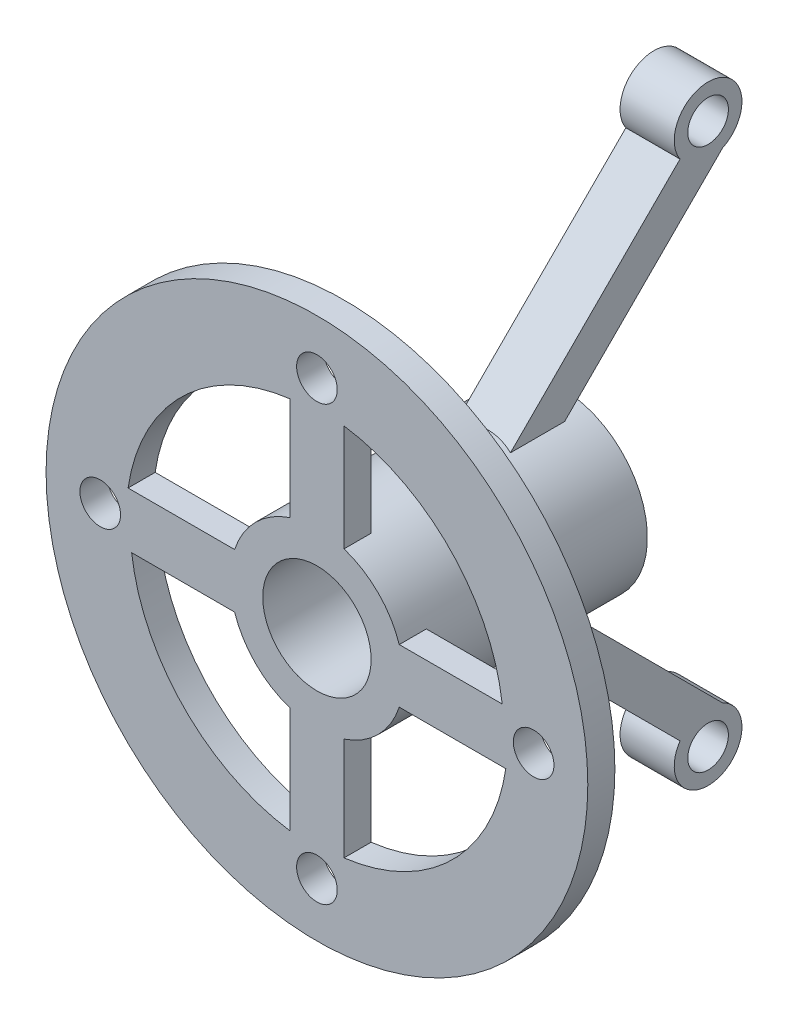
ISO-10303-21;
HEADER;
FILE_DESCRIPTION(('STEP AP214'),'2;1');
FILE_NAME('part.step','',(''),(''),'','','');
FILE_SCHEMA(('AUTOMOTIVE_DESIGN { 1 0 10303 214 1 1 1 1 }'));
ENDSEC;
DATA;
#1=APPLICATION_CONTEXT('core data for automotive mechanical design processes');
#2=APPLICATION_PROTOCOL_DEFINITION('international standard','automotive_design',2000,#1);
#3=PRODUCT_CONTEXT('',#1,'mechanical');
#4=PRODUCT('Part','Part','',(#3));
#5=PRODUCT_RELATED_PRODUCT_CATEGORY('part','',(#4));
#6=PRODUCT_DEFINITION_FORMATION('','',#4);
#7=PRODUCT_DEFINITION_CONTEXT('part definition',#1,'design');
#8=PRODUCT_DEFINITION('design','',#6,#7);
#9=PRODUCT_DEFINITION_SHAPE('','',#8);
#10=(LENGTH_UNIT() NAMED_UNIT(*) SI_UNIT(.MILLI.,.METRE.));
#11=(NAMED_UNIT(*) PLANE_ANGLE_UNIT() SI_UNIT($,.RADIAN.));
#12=(NAMED_UNIT(*) SI_UNIT($,.STERADIAN.) SOLID_ANGLE_UNIT());
#13=UNCERTAINTY_MEASURE_WITH_UNIT(LENGTH_MEASURE(1.E-05),#10,'distance_accuracy_value','');
#14=(GEOMETRIC_REPRESENTATION_CONTEXT(3) GLOBAL_UNCERTAINTY_ASSIGNED_CONTEXT((#13)) GLOBAL_UNIT_ASSIGNED_CONTEXT((#10,
#11,#12)) REPRESENTATION_CONTEXT('',''));
#15=CARTESIAN_POINT('',(0.,0.,0.));
#16=DIRECTION('',(0.,0.,1.));
#17=DIRECTION('',(1.,0.,0.));
#18=AXIS2_PLACEMENT_3D('',#15,#16,#17);
#19=CARTESIAN_POINT('',(6.35,-15.2106724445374,-44.45));
#20=DIRECTION('',(0.,-0.707106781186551,0.707106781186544));
#21=DIRECTION('',(0.,-0.707106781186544,-0.707106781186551));
#22=AXIS2_PLACEMENT_3D('',#19,#20,#21);
#23=PLANE('',#22);
#24=DIRECTION('',(-1.,0.,0.));
#25=VECTOR('',#24,1.);
#26=CARTESIAN_POINT('',(6.35,-56.3219052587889,-85.5612328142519));
#27=LINE('',#26,#25);
#28=CARTESIAN_POINT('',(-6.35,-56.3219052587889,-85.5612328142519));
#29=VERTEX_POINT('',#28);
#30=CARTESIAN_POINT('',(6.35,-56.3219052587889,-85.5612328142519));
#31=VERTEX_POINT('',#30);
#32=EDGE_CURVE('E51',#29,#31,#27,.F.);
#33=ORIENTED_EDGE('',*,*,#32,.F.);
#34=DIRECTION('',(0.,0.707106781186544,0.707106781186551));
#35=VECTOR('',#34,1.);
#36=CARTESIAN_POINT('',(-6.35,-15.2106724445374,-44.45));
#37=LINE('',#36,#35);
#38=CARTESIAN_POINT('',(-6.35,-19.3023288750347,-48.5416564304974));
#39=VERTEX_POINT('',#38);
#40=EDGE_CURVE('E187',#29,#39,#37,.T.);
#41=ORIENTED_EDGE('',*,*,#40,.T.);
#42=CARTESIAN_POINT('',(0.,0.,-29.2393275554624));
#43=DIRECTION('',(0.,-0.707106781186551,0.707106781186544));
#44=DIRECTION('',(0.,-0.707106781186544,-0.707106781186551));
#45=AXIS2_PLACEMENT_3D('',#42,#43,#44);
#46=ELLIPSE('',#45,28.7368195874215,20.32);
#47=CARTESIAN_POINT('',(6.35,-19.3023288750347,-48.5416564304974));
#48=VERTEX_POINT('',#47);
#49=EDGE_CURVE('E40',#39,#48,#46,.T.);
#50=ORIENTED_EDGE('',*,*,#49,.T.);
#51=DIRECTION('',(0.,0.707106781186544,0.707106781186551));
#52=VECTOR('',#51,1.);
#53=CARTESIAN_POINT('',(6.35,-15.2106724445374,-44.45));
#54=LINE('',#53,#52);
#55=EDGE_CURVE('E47',#31,#48,#54,.T.);
#56=ORIENTED_EDGE('',*,*,#55,.F.);
#57=EDGE_LOOP('',(#33,#41,#50,#56));
#58=FACE_BOUND('',#57,.T.);
#59=ADVANCED_FACE('F32',(#58),#23,.F.);
#60=CARTESIAN_POINT('',(6.35,-60.1119530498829,-76.651280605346));
#61=DIRECTION('',(0.,0.707106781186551,-0.707106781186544));
#62=DIRECTION('',(0.,0.707106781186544,0.707106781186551));
#63=AXIS2_PLACEMENT_3D('',#60,#61,#62);
#64=PLANE('',#63);
#65=DIRECTION('',(-1.,0.,0.));
#66=VECTOR('',#65,1.);
#67=CARTESIAN_POINT('',(6.35,-59.0566101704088,-75.5959377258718));
#68=LINE('',#67,#66);
#69=CARTESIAN_POINT('',(6.35,-59.0566101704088,-75.5959377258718));
#70=VERTEX_POINT('',#69);
#71=CARTESIAN_POINT('',(-6.35,-59.0566101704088,-75.5959377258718));
#72=VERTEX_POINT('',#71);
#73=EDGE_CURVE('E412',#70,#72,#68,.T.);
#74=ORIENTED_EDGE('',*,*,#73,.F.);
#75=DIRECTION('',(0.,-0.707106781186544,-0.707106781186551));
#76=VECTOR('',#75,1.);
#77=CARTESIAN_POINT('',(6.35,-60.1119530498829,-76.651280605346));
#78=LINE('',#77,#76);
#79=CARTESIAN_POINT('',(6.35,-19.3023288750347,-35.8416564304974));
#80=VERTEX_POINT('',#79);
#81=EDGE_CURVE('E392',#80,#70,#78,.T.);
#82=ORIENTED_EDGE('',*,*,#81,.F.);
#83=CARTESIAN_POINT('',(0.,0.,-16.5393275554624));
#84=DIRECTION('',(0.,0.707106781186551,-0.707106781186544));
#85=DIRECTION('',(0.,-0.707106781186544,-0.707106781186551));
#86=AXIS2_PLACEMENT_3D('',#83,#84,#85);
#87=ELLIPSE('',#86,28.7368195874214,20.32);
#88=CARTESIAN_POINT('',(-6.35,-19.3023288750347,-35.8416564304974));
#89=VERTEX_POINT('',#88);
#90=EDGE_CURVE('E203',#80,#89,#87,.T.);
#91=ORIENTED_EDGE('',*,*,#90,.T.);
#92=DIRECTION('',(0.,-0.707106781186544,-0.707106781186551));
#93=VECTOR('',#92,1.);
#94=CARTESIAN_POINT('',(-6.35,-60.1119530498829,-76.651280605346));
#95=LINE('',#94,#93);
#96=EDGE_CURVE('E193',#89,#72,#95,.T.);
#97=ORIENTED_EDGE('',*,*,#96,.T.);
#98=EDGE_LOOP('',(#74,#82,#91,#97));
#99=FACE_BOUND('',#98,.T.);
#100=ADVANCED_FACE('F443',(#99),#64,.F.);
#101=CARTESIAN_POINT('',(6.35,60.1119530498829,-76.651280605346));
#102=DIRECTION('',(0.,-0.707106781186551,-0.707106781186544));
#103=DIRECTION('',(0.,0.707106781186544,-0.707106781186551));
#104=AXIS2_PLACEMENT_3D('',#101,#102,#103);
#105=PLANE('',#104);
#106=DIRECTION('',(-1.,0.,0.));
#107=VECTOR('',#106,1.);
#108=CARTESIAN_POINT('',(6.35,59.0566101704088,-75.5959377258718));
#109=LINE('',#108,#107);
#110=CARTESIAN_POINT('',(-6.35,59.0566101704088,-75.5959377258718));
#111=VERTEX_POINT('',#110);
#112=CARTESIAN_POINT('',(6.35,59.0566101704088,-75.5959377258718));
#113=VERTEX_POINT('',#112);
#114=EDGE_CURVE('E194',#111,#113,#109,.F.);
#115=ORIENTED_EDGE('',*,*,#114,.F.);
#116=DIRECTION('',(0.,-0.707106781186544,0.707106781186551));
#117=VECTOR('',#116,1.);
#118=CARTESIAN_POINT('',(-6.35,60.1119530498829,-76.651280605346));
#119=LINE('',#118,#117);
#120=CARTESIAN_POINT('',(-6.35,19.3023288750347,-35.8416564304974));
#121=VERTEX_POINT('',#120);
#122=EDGE_CURVE('E390',#111,#121,#119,.T.);
#123=ORIENTED_EDGE('',*,*,#122,.T.);
#124=CARTESIAN_POINT('',(0.,0.,-16.5393275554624));
#125=DIRECTION('',(0.,-0.707106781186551,-0.707106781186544));
#126=DIRECTION('',(0.,0.707106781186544,-0.707106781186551));
#127=AXIS2_PLACEMENT_3D('',#124,#125,#126);
#128=ELLIPSE('',#127,28.7368195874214,20.32);
#129=CARTESIAN_POINT('',(6.35,19.3023288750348,-35.8416564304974));
#130=VERTEX_POINT('',#129);
#131=EDGE_CURVE('E211',#121,#130,#128,.T.);
#132=ORIENTED_EDGE('',*,*,#131,.T.);
#133=DIRECTION('',(0.,-0.707106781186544,0.707106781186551));
#134=VECTOR('',#133,1.);
#135=CARTESIAN_POINT('',(6.35,60.1119530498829,-76.651280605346));
#136=LINE('',#135,#134);
#137=EDGE_CURVE('E389',#113,#130,#136,.T.);
#138=ORIENTED_EDGE('',*,*,#137,.F.);
#139=EDGE_LOOP('',(#115,#123,#132,#138));
#140=FACE_BOUND('',#139,.T.);
#141=ADVANCED_FACE('F463',(#140),#105,.F.);
#142=CARTESIAN_POINT('',(6.35,15.2106724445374,-44.45));
#143=DIRECTION('',(0.,0.707106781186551,0.707106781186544));
#144=DIRECTION('',(0.,-0.707106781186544,0.707106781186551));
#145=AXIS2_PLACEMENT_3D('',#142,#143,#144);
#146=PLANE('',#145);
#147=DIRECTION('',(-1.,0.,0.));
#148=VECTOR('',#147,1.);
#149=CARTESIAN_POINT('',(6.35,56.3219052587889,-85.5612328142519));
#150=LINE('',#149,#148);
#151=CARTESIAN_POINT('',(6.35,56.3219052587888,-85.5612328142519));
#152=VERTEX_POINT('',#151);
#153=CARTESIAN_POINT('',(-6.35,56.3219052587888,-85.5612328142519));
#154=VERTEX_POINT('',#153);
#155=EDGE_CURVE('E402',#152,#154,#150,.T.);
#156=ORIENTED_EDGE('',*,*,#155,.F.);
#157=DIRECTION('',(0.,0.707106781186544,-0.707106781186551));
#158=VECTOR('',#157,1.);
#159=CARTESIAN_POINT('',(6.35,15.2106724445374,-44.45));
#160=LINE('',#159,#158);
#161=CARTESIAN_POINT('',(6.35,19.3023288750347,-48.5416564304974));
#162=VERTEX_POINT('',#161);
#163=EDGE_CURVE('E385',#162,#152,#160,.T.);
#164=ORIENTED_EDGE('',*,*,#163,.F.);
#165=CARTESIAN_POINT('',(0.,0.,-29.2393275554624));
#166=DIRECTION('',(0.,0.707106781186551,0.707106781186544));
#167=DIRECTION('',(0.,0.707106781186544,-0.707106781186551));
#168=AXIS2_PLACEMENT_3D('',#165,#166,#167);
#169=ELLIPSE('',#168,28.7368195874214,20.32);
#170=CARTESIAN_POINT('',(-6.35,19.3023288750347,-48.5416564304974));
#171=VERTEX_POINT('',#170);
#172=EDGE_CURVE('E214',#162,#171,#169,.T.);
#173=ORIENTED_EDGE('',*,*,#172,.T.);
#174=DIRECTION('',(0.,0.707106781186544,-0.707106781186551));
#175=VECTOR('',#174,1.);
#176=CARTESIAN_POINT('',(-6.35,15.2106724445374,-44.45));
#177=LINE('',#176,#175);
#178=EDGE_CURVE('E386',#171,#154,#177,.T.);
#179=ORIENTED_EDGE('',*,*,#178,.T.);
#180=EDGE_LOOP('',(#156,#164,#173,#179));
#181=FACE_BOUND('',#180,.T.);
#182=ADVANCED_FACE('F475',(#181),#146,.F.);
#183=CARTESIAN_POINT('',(0.,0.,3.176));
#184=DIRECTION('',(0.,0.,-1.));
#185=DIRECTION('',(-1.,0.,0.));
#186=AXIS2_PLACEMENT_3D('',#183,#184,#185);
#187=CYLINDRICAL_SURFACE('',#186,20.32);
#188=CARTESIAN_POINT('',(0.,0.,-53.975));
#189=DIRECTION('',(0.,0.,-1.));
#190=DIRECTION('',(-1.,0.,0.));
#191=AXIS2_PLACEMENT_3D('',#188,#189,#190);
#192=CIRCLE('',#191,20.32);
#193=CARTESIAN_POINT('',(-20.32,0.,-53.975));
#194=VERTEX_POINT('',#193);
#195=EDGE_CURVE('E287',#194,#194,#192,.T.);
#196=ORIENTED_EDGE('',*,*,#195,.F.);
#197=EDGE_LOOP('',(#196));
#198=FACE_BOUND('',#197,.T.);
#199=DIRECTION('',(0.,0.,-1.));
#200=VECTOR('',#199,1.);
#201=CARTESIAN_POINT('',(19.3023288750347,6.35,3.176));
#202=LINE('',#201,#200);
#203=CARTESIAN_POINT('',(19.3023288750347,6.35,3.175));
#204=VERTEX_POINT('',#203);
#205=CARTESIAN_POINT('',(19.3023288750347,6.35,-3.175));
#206=VERTEX_POINT('',#205);
#207=EDGE_CURVE('E351',#204,#206,#202,.T.);
#208=ORIENTED_EDGE('',*,*,#207,.T.);
#209=CARTESIAN_POINT('',(0.,0.,-3.175));
#210=DIRECTION('',(0.,0.,-1.));
#211=DIRECTION('',(-1.,0.,0.));
#212=AXIS2_PLACEMENT_3D('',#209,#210,#211);
#213=CIRCLE('',#212,20.32);
#214=CARTESIAN_POINT('',(19.3023288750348,-6.3499999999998,-3.175));
#215=VERTEX_POINT('',#214);
#216=EDGE_CURVE('E379',#206,#215,#213,.T.);
#217=ORIENTED_EDGE('',*,*,#216,.T.);
#218=DIRECTION('',(0.,0.,-1.));
#219=VECTOR('',#218,1.);
#220=CARTESIAN_POINT('',(19.3023288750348,-6.3499999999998,3.176));
#221=LINE('',#220,#219);
#222=CARTESIAN_POINT('',(19.3023288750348,-6.3499999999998,3.175));
#223=VERTEX_POINT('',#222);
#224=EDGE_CURVE('E261',#223,#215,#221,.T.);
#225=ORIENTED_EDGE('',*,*,#224,.F.);
#226=CARTESIAN_POINT('',(0.,0.,3.175));
#227=DIRECTION('',(0.,0.,1.));
#228=DIRECTION('',(1.,0.,0.));
#229=AXIS2_PLACEMENT_3D('',#226,#227,#228);
#230=CIRCLE('',#229,20.32);
#231=CARTESIAN_POINT('',(6.3500000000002,-19.3023288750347,3.175));
#232=VERTEX_POINT('',#231);
#233=EDGE_CURVE('E278',#232,#223,#230,.T.);
#234=ORIENTED_EDGE('',*,*,#233,.F.);
#235=DIRECTION('',(0.,0.,-1.));
#236=VECTOR('',#235,1.);
#237=CARTESIAN_POINT('',(6.3500000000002,-19.3023288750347,3.176));
#238=LINE('',#237,#236);
#239=CARTESIAN_POINT('',(6.3500000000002,-19.3023288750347,-3.175));
#240=VERTEX_POINT('',#239);
#241=EDGE_CURVE('E260',#232,#240,#238,.T.);
#242=ORIENTED_EDGE('',*,*,#241,.T.);
#243=CARTESIAN_POINT('',(-6.34999999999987,-19.3023288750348,-3.175));
#244=VERTEX_POINT('',#243);
#245=EDGE_CURVE('E828',#240,#244,#213,.T.);
#246=ORIENTED_EDGE('',*,*,#245,.T.);
#247=DIRECTION('',(0.,0.,-1.));
#248=VECTOR('',#247,1.);
#249=CARTESIAN_POINT('',(-6.34999999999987,-19.3023288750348,3.176));
#250=LINE('',#249,#248);
#251=CARTESIAN_POINT('',(-6.34999999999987,-19.3023288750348,3.175));
#252=VERTEX_POINT('',#251);
#253=EDGE_CURVE('E293',#252,#244,#250,.T.);
#254=ORIENTED_EDGE('',*,*,#253,.F.);
#255=CARTESIAN_POINT('',(0.,0.,3.175));
#256=DIRECTION('',(0.,0.,1.));
#257=DIRECTION('',(1.,0.,0.));
#258=AXIS2_PLACEMENT_3D('',#255,#256,#257);
#259=CIRCLE('',#258,20.32);
#260=CARTESIAN_POINT('',(-19.3023288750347,-6.35000000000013,3.175));
#261=VERTEX_POINT('',#260);
#262=EDGE_CURVE('E310',#261,#252,#259,.T.);
#263=ORIENTED_EDGE('',*,*,#262,.F.);
#264=DIRECTION('',(0.,0.,-1.));
#265=VECTOR('',#264,1.);
#266=CARTESIAN_POINT('',(-19.3023288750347,-6.35000000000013,3.176));
#267=LINE('',#266,#265);
#268=CARTESIAN_POINT('',(-19.3023288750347,-6.35000000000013,-3.175));
#269=VERTEX_POINT('',#268);
#270=EDGE_CURVE('E292',#261,#269,#267,.T.);
#271=ORIENTED_EDGE('',*,*,#270,.T.);
#272=CARTESIAN_POINT('',(-19.3023288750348,6.34999999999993,-3.175));
#273=VERTEX_POINT('',#272);
#274=EDGE_CURVE('E228',#269,#273,#213,.T.);
#275=ORIENTED_EDGE('',*,*,#274,.T.);
#276=DIRECTION('',(0.,0.,-1.));
#277=VECTOR('',#276,1.);
#278=CARTESIAN_POINT('',(-19.3023288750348,6.34999999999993,3.176));
#279=LINE('',#278,#277);
#280=CARTESIAN_POINT('',(-19.3023288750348,6.34999999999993,3.175));
#281=VERTEX_POINT('',#280);
#282=EDGE_CURVE('E323',#281,#273,#279,.T.);
#283=ORIENTED_EDGE('',*,*,#282,.F.);
#284=CARTESIAN_POINT('',(0.,0.,3.175));
#285=DIRECTION('',(0.,0.,1.));
#286=DIRECTION('',(1.,0.,0.));
#287=AXIS2_PLACEMENT_3D('',#284,#285,#286);
#288=CIRCLE('',#287,20.32);
#289=CARTESIAN_POINT('',(-6.35000000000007,19.3023288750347,3.175));
#290=VERTEX_POINT('',#289);
#291=EDGE_CURVE('E341',#290,#281,#288,.T.);
#292=ORIENTED_EDGE('',*,*,#291,.F.);
#293=DIRECTION('',(0.,0.,-1.));
#294=VECTOR('',#293,1.);
#295=CARTESIAN_POINT('',(-6.35000000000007,19.3023288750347,3.176));
#296=LINE('',#295,#294);
#297=CARTESIAN_POINT('',(-6.35000000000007,19.3023288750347,-3.175));
#298=VERTEX_POINT('',#297);
#299=EDGE_CURVE('E322',#290,#298,#296,.T.);
#300=ORIENTED_EDGE('',*,*,#299,.T.);
#301=CARTESIAN_POINT('',(6.35,19.3023288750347,-3.175));
#302=VERTEX_POINT('',#301);
#303=EDGE_CURVE('E220',#298,#302,#213,.T.);
#304=ORIENTED_EDGE('',*,*,#303,.T.);
#305=DIRECTION('',(0.,0.,-1.));
#306=VECTOR('',#305,1.);
#307=CARTESIAN_POINT('',(6.35,19.3023288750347,3.176));
#308=LINE('',#307,#306);
#309=CARTESIAN_POINT('',(6.35,19.3023288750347,3.175));
#310=VERTEX_POINT('',#309);
#311=EDGE_CURVE('E352',#310,#302,#308,.T.);
#312=ORIENTED_EDGE('',*,*,#311,.F.);
#313=CARTESIAN_POINT('',(0.,0.,3.175));
#314=DIRECTION('',(0.,0.,1.));
#315=DIRECTION('',(1.,0.,0.));
#316=AXIS2_PLACEMENT_3D('',#313,#314,#315);
#317=CIRCLE('',#316,20.32);
#318=EDGE_CURVE('E369',#204,#310,#317,.T.);
#319=ORIENTED_EDGE('',*,*,#318,.F.);
#320=EDGE_LOOP('',(#208,#217,#225,#234,#242,#246,#254,#263,#271,#275,#283,#292,#300,#304,#312,#319));
#321=FACE_BOUND('',#320,.T.);
#322=ORIENTED_EDGE('',*,*,#172,.F.);
#323=DIRECTION('',(0.,0.,-1.));
#324=VECTOR('',#323,1.);
#325=CARTESIAN_POINT('',(6.35,19.3023288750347,3.176));
#326=LINE('',#325,#324);
#327=EDGE_CURVE('E204',#162,#130,#326,.F.);
#328=ORIENTED_EDGE('',*,*,#327,.T.);
#329=ORIENTED_EDGE('',*,*,#131,.F.);
#330=DIRECTION('',(0.,0.,-1.));
#331=VECTOR('',#330,1.);
#332=CARTESIAN_POINT('',(-6.35,19.3023288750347,3.176));
#333=LINE('',#332,#331);
#334=EDGE_CURVE('E217',#171,#121,#333,.F.);
#335=ORIENTED_EDGE('',*,*,#334,.F.);
#336=EDGE_LOOP('',(#322,#328,#329,#335));
#337=FACE_BOUND('',#336,.T.);
#338=DIRECTION('',(0.,0.,-1.));
#339=VECTOR('',#338,1.);
#340=CARTESIAN_POINT('',(6.35,-19.3023288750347,3.176));
#341=LINE('',#340,#339);
#342=EDGE_CURVE('E11',#48,#80,#341,.F.);
#343=ORIENTED_EDGE('',*,*,#342,.F.);
#344=ORIENTED_EDGE('',*,*,#49,.F.);
#345=DIRECTION('',(0.,0.,-1.));
#346=VECTOR('',#345,1.);
#347=CARTESIAN_POINT('',(-6.35,-19.3023288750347,3.176));
#348=LINE('',#347,#346);
#349=EDGE_CURVE('E197',#39,#89,#348,.F.);
#350=ORIENTED_EDGE('',*,*,#349,.T.);
#351=ORIENTED_EDGE('',*,*,#90,.F.);
#352=EDGE_LOOP('',(#343,#344,#350,#351));
#353=FACE_BOUND('',#352,.T.);
#354=ADVANCED_FACE('F206',(#198,#321,#337,#353),#187,.T.);
#355=CARTESIAN_POINT('',(0.,0.,3.175));
#356=DIRECTION('',(0.,0.,-1.));
#357=DIRECTION('',(-1.,0.,0.));
#358=AXIS2_PLACEMENT_3D('',#355,#356,#357);
#359=CYLINDRICAL_SURFACE('',#358,63.5);
#360=CARTESIAN_POINT('',(0.,0.,3.175));
#361=DIRECTION('',(0.,0.,1.));
#362=DIRECTION('',(1.,0.,0.));
#363=AXIS2_PLACEMENT_3D('',#360,#361,#362);
#364=CIRCLE('',#363,63.5);
#365=CARTESIAN_POINT('',(63.5,0.,3.175));
#366=VERTEX_POINT('',#365);
#367=EDGE_CURVE('E224',#366,#366,#364,.T.);
#368=ORIENTED_EDGE('',*,*,#367,.F.);
#369=EDGE_LOOP('',(#368));
#370=FACE_BOUND('',#369,.T.);
#371=CARTESIAN_POINT('',(0.,0.,-3.175));
#372=DIRECTION('',(0.,0.,1.));
#373=DIRECTION('',(1.,0.,0.));
#374=AXIS2_PLACEMENT_3D('',#371,#372,#373);
#375=CIRCLE('',#374,63.5);
#376=CARTESIAN_POINT('',(63.5,0.,-3.175));
#377=VERTEX_POINT('',#376);
#378=EDGE_CURVE('E221',#377,#377,#375,.T.);
#379=ORIENTED_EDGE('',*,*,#378,.T.);
#380=EDGE_LOOP('',(#379));
#381=FACE_BOUND('',#380,.T.);
#382=ADVANCED_FACE('F34',(#370,#381),#359,.T.);
#383=CARTESIAN_POINT('',(0.,0.,3.175));
#384=DIRECTION('',(0.,0.,1.));
#385=DIRECTION('',(1.,0.,0.));
#386=AXIS2_PLACEMENT_3D('',#383,#384,#385);
#387=PLANE('',#386);
#388=ORIENTED_EDGE('',*,*,#318,.T.);
#389=DIRECTION('',(0.,1.,0.));
#390=VECTOR('',#389,1.);
#391=CARTESIAN_POINT('',(6.35,19.3023288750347,3.175));
#392=LINE('',#391,#390);
#393=CARTESIAN_POINT('',(6.35,44.2743722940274,3.175));
#394=VERTEX_POINT('',#393);
#395=EDGE_CURVE('E255',#310,#394,#392,.T.);
#396=ORIENTED_EDGE('',*,*,#395,.T.);
#397=CARTESIAN_POINT('',(0.,0.973685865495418,3.175));
#398=DIRECTION('',(0.,0.,1.));
#399=DIRECTION('',(1.,0.,0.));
#400=AXIS2_PLACEMENT_3D('',#397,#398,#399);
#401=CIRCLE('',#400,43.7638200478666);
#402=CARTESIAN_POINT('',(43.4323288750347,6.35,3.175));
#403=VERTEX_POINT('',#402);
#404=EDGE_CURVE('E321',#394,#403,#401,.F.);
#405=ORIENTED_EDGE('',*,*,#404,.T.);
#406=DIRECTION('',(-1.,0.,0.));
#407=VECTOR('',#406,1.);
#408=CARTESIAN_POINT('',(19.3023288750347,6.35,3.175));
#409=LINE('',#408,#407);
#410=EDGE_CURVE('E372',#403,#204,#409,.T.);
#411=ORIENTED_EDGE('',*,*,#410,.T.);
#412=EDGE_LOOP('',(#388,#396,#405,#411));
#413=FACE_BOUND('',#412,.T.);
#414=ORIENTED_EDGE('',*,*,#291,.T.);
#415=DIRECTION('',(-1.,0.,0.));
#416=VECTOR('',#415,1.);
#417=CARTESIAN_POINT('',(-19.3023288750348,6.34999999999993,3.175));
#418=LINE('',#417,#416);
#419=CARTESIAN_POINT('',(-44.2743722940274,6.34999999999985,3.175));
#420=VERTEX_POINT('',#419);
#421=EDGE_CURVE('E318',#281,#420,#418,.T.);
#422=ORIENTED_EDGE('',*,*,#421,.T.);
#423=CARTESIAN_POINT('',(-0.973685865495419,0.,3.175));
#424=DIRECTION('',(0.,0.,1.));
#425=DIRECTION('',(1.,0.,0.));
#426=AXIS2_PLACEMENT_3D('',#423,#424,#425);
#427=CIRCLE('',#426,43.7638200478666);
#428=CARTESIAN_POINT('',(-6.35000000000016,43.4323288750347,3.175));
#429=VERTEX_POINT('',#428);
#430=EDGE_CURVE('E291',#420,#429,#427,.F.);
#431=ORIENTED_EDGE('',*,*,#430,.T.);
#432=DIRECTION('',(0.,-1.,0.));
#433=VECTOR('',#432,1.);
#434=CARTESIAN_POINT('',(-6.35000000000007,19.3023288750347,3.175));
#435=LINE('',#434,#433);
#436=EDGE_CURVE('E344',#429,#290,#435,.T.);
#437=ORIENTED_EDGE('',*,*,#436,.T.);
#438=EDGE_LOOP('',(#414,#422,#431,#437));
#439=FACE_BOUND('',#438,.T.);
#440=ORIENTED_EDGE('',*,*,#262,.T.);
#441=DIRECTION('',(0.,-1.,0.));
#442=VECTOR('',#441,1.);
#443=CARTESIAN_POINT('',(-6.34999999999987,-19.3023288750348,3.175));
#444=LINE('',#443,#442);
#445=CARTESIAN_POINT('',(-6.34999999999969,-44.2743722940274,3.175));
#446=VERTEX_POINT('',#445);
#447=EDGE_CURVE('E288',#252,#446,#444,.T.);
#448=ORIENTED_EDGE('',*,*,#447,.T.);
#449=CARTESIAN_POINT('',(0.,-0.973685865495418,3.175));
#450=DIRECTION('',(0.,0.,1.));
#451=DIRECTION('',(1.,0.,0.));
#452=AXIS2_PLACEMENT_3D('',#449,#450,#451);
#453=CIRCLE('',#452,43.7638200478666);
#454=CARTESIAN_POINT('',(-43.4323288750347,-6.35000000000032,3.175));
#455=VERTEX_POINT('',#454);
#456=EDGE_CURVE('E259',#446,#455,#453,.F.);
#457=ORIENTED_EDGE('',*,*,#456,.T.);
#458=DIRECTION('',(1.,0.,0.));
#459=VECTOR('',#458,1.);
#460=CARTESIAN_POINT('',(-19.3023288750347,-6.35000000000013,3.175));
#461=LINE('',#460,#459);
#462=EDGE_CURVE('E313',#455,#261,#461,.T.);
#463=ORIENTED_EDGE('',*,*,#462,.T.);
#464=EDGE_LOOP('',(#440,#448,#457,#463));
#465=FACE_BOUND('',#464,.T.);
#466=ORIENTED_EDGE('',*,*,#233,.T.);
#467=DIRECTION('',(1.,0.,0.));
#468=VECTOR('',#467,1.);
#469=CARTESIAN_POINT('',(19.3023288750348,-6.3499999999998,3.175));
#470=LINE('',#469,#468);
#471=CARTESIAN_POINT('',(44.2743722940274,-6.34999999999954,3.175));
#472=VERTEX_POINT('',#471);
#473=EDGE_CURVE('E256',#223,#472,#470,.T.);
#474=ORIENTED_EDGE('',*,*,#473,.T.);
#475=CARTESIAN_POINT('',(0.973685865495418,0.,3.175));
#476=DIRECTION('',(0.,0.,1.));
#477=DIRECTION('',(1.,0.,0.));
#478=AXIS2_PLACEMENT_3D('',#475,#476,#477);
#479=CIRCLE('',#478,43.7638200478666);
#480=CARTESIAN_POINT('',(6.35000000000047,-43.4323288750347,3.175));
#481=VERTEX_POINT('',#480);
#482=EDGE_CURVE('E284',#472,#481,#479,.F.);
#483=ORIENTED_EDGE('',*,*,#482,.T.);
#484=DIRECTION('',(0.,1.,0.));
#485=VECTOR('',#484,1.);
#486=CARTESIAN_POINT('',(6.3500000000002,-19.3023288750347,3.175));
#487=LINE('',#486,#485);
#488=EDGE_CURVE('E281',#481,#232,#487,.T.);
#489=ORIENTED_EDGE('',*,*,#488,.T.);
#490=EDGE_LOOP('',(#466,#474,#483,#489));
#491=FACE_BOUND('',#490,.T.);
#492=CARTESIAN_POINT('',(0.,0.,3.175));
#493=DIRECTION('',(0.,0.,1.));
#494=DIRECTION('',(1.,0.,0.));
#495=AXIS2_PLACEMENT_3D('',#492,#493,#494);
#496=CIRCLE('',#495,12.7);
#497=CARTESIAN_POINT('',(12.7,0.,3.175));
#498=VERTEX_POINT('',#497);
#499=EDGE_CURVE('E248',#498,#498,#496,.F.);
#500=ORIENTED_EDGE('',*,*,#499,.T.);
#501=EDGE_LOOP('',(#500));
#502=FACE_BOUND('',#501,.T.);
#503=CARTESIAN_POINT('',(0.,-50.8,3.175));
#504=DIRECTION('',(0.,0.,1.));
#505=DIRECTION('',(-1.,0.,0.));
#506=AXIS2_PLACEMENT_3D('',#503,#504,#505);
#507=CIRCLE('',#506,4.7625);
#508=CARTESIAN_POINT('',(-4.7625,-50.8,3.175));
#509=VERTEX_POINT('',#508);
#510=EDGE_CURVE('E244',#509,#509,#507,.T.);
#511=ORIENTED_EDGE('',*,*,#510,.F.);
#512=EDGE_LOOP('',(#511));
#513=FACE_BOUND('',#512,.T.);
#514=CARTESIAN_POINT('',(-50.8,5.32101756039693E-13,3.175));
#515=DIRECTION('',(0.,0.,1.));
#516=DIRECTION('',(0.,1.,0.));
#517=AXIS2_PLACEMENT_3D('',#514,#515,#516);
#518=CIRCLE('',#517,4.7625);
#519=CARTESIAN_POINT('',(-50.7999999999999,4.76250000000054,3.175));
#520=VERTEX_POINT('',#519);
#521=EDGE_CURVE('E245',#520,#520,#518,.T.);
#522=ORIENTED_EDGE('',*,*,#521,.F.);
#523=EDGE_LOOP('',(#522));
#524=FACE_BOUND('',#523,.T.);
#525=CARTESIAN_POINT('',(50.8,-1.77367252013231E-13,3.175));
#526=DIRECTION('',(0.,0.,1.));
#527=DIRECTION('',(0.,-1.,0.));
#528=AXIS2_PLACEMENT_3D('',#525,#526,#527);
#529=CIRCLE('',#528,4.7625);
#530=CARTESIAN_POINT('',(50.8,-4.76250000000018,3.175));
#531=VERTEX_POINT('',#530);
#532=EDGE_CURVE('E237',#531,#531,#529,.T.);
#533=ORIENTED_EDGE('',*,*,#532,.F.);
#534=EDGE_LOOP('',(#533));
#535=FACE_BOUND('',#534,.T.);
#536=CARTESIAN_POINT('',(0.,50.8,3.175));
#537=DIRECTION('',(0.,0.,1.));
#538=DIRECTION('',(1.,0.,0.));
#539=AXIS2_PLACEMENT_3D('',#536,#537,#538);
#540=CIRCLE('',#539,4.7625);
#541=CARTESIAN_POINT('',(4.7625,50.8,3.175));
#542=VERTEX_POINT('',#541);
#543=EDGE_CURVE('E231',#542,#542,#540,.T.);
#544=ORIENTED_EDGE('',*,*,#543,.F.);
#545=EDGE_LOOP('',(#544));
#546=FACE_BOUND('',#545,.T.);
#547=ORIENTED_EDGE('',*,*,#367,.T.);
#548=EDGE_LOOP('',(#547));
#549=FACE_BOUND('',#548,.T.);
#550=ADVANCED_FACE('F557',(#413,#439,#465,#491,#502,#513,#524,#535,#546,#549),#387,.T.);
#551=CARTESIAN_POINT('',(0.,0.,-3.175));
#552=DIRECTION('',(0.,0.,1.));
#553=DIRECTION('',(1.,0.,0.));
#554=AXIS2_PLACEMENT_3D('',#551,#552,#553);
#555=PLANE('',#554);
#556=ORIENTED_EDGE('',*,*,#303,.F.);
#557=DIRECTION('',(0.,-1.,0.));
#558=VECTOR('',#557,1.);
#559=CARTESIAN_POINT('',(-6.35000000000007,19.3023288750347,-3.175));
#560=LINE('',#559,#558);
#561=CARTESIAN_POINT('',(-6.35000000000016,43.4323288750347,-3.175));
#562=VERTEX_POINT('',#561);
#563=EDGE_CURVE('E327',#562,#298,#560,.T.);
#564=ORIENTED_EDGE('',*,*,#563,.F.);
#565=CARTESIAN_POINT('',(-0.973685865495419,0.,-3.175));
#566=DIRECTION('',(0.,0.,-1.));
#567=DIRECTION('',(-1.,0.,0.));
#568=AXIS2_PLACEMENT_3D('',#565,#566,#567);
#569=CIRCLE('',#568,43.7638200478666);
#570=CARTESIAN_POINT('',(-44.2743722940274,6.34999999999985,-3.175));
#571=VERTEX_POINT('',#570);
#572=EDGE_CURVE('E335',#571,#562,#569,.T.);
#573=ORIENTED_EDGE('',*,*,#572,.F.);
#574=DIRECTION('',(-1.,0.,0.));
#575=VECTOR('',#574,1.);
#576=CARTESIAN_POINT('',(-19.3023288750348,6.34999999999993,-3.175));
#577=LINE('',#576,#575);
#578=EDGE_CURVE('E338',#273,#571,#577,.T.);
#579=ORIENTED_EDGE('',*,*,#578,.F.);
#580=ORIENTED_EDGE('',*,*,#274,.F.);
#581=DIRECTION('',(1.,0.,0.));
#582=VECTOR('',#581,1.);
#583=CARTESIAN_POINT('',(-19.3023288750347,-6.35000000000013,-3.175));
#584=LINE('',#583,#582);
#585=CARTESIAN_POINT('',(-43.4323288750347,-6.35000000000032,-3.175));
#586=VERTEX_POINT('',#585);
#587=EDGE_CURVE('E296',#586,#269,#584,.T.);
#588=ORIENTED_EDGE('',*,*,#587,.F.);
#589=CARTESIAN_POINT('',(0.,-0.973685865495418,-3.175));
#590=DIRECTION('',(0.,0.,-1.));
#591=DIRECTION('',(-1.,0.,0.));
#592=AXIS2_PLACEMENT_3D('',#589,#590,#591);
#593=CIRCLE('',#592,43.7638200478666);
#594=CARTESIAN_POINT('',(-6.34999999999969,-44.2743722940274,-3.175));
#595=VERTEX_POINT('',#594);
#596=EDGE_CURVE('E304',#595,#586,#593,.T.);
#597=ORIENTED_EDGE('',*,*,#596,.F.);
#598=DIRECTION('',(0.,-1.,0.));
#599=VECTOR('',#598,1.);
#600=CARTESIAN_POINT('',(-6.34999999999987,-19.3023288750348,-3.175));
#601=LINE('',#600,#599);
#602=EDGE_CURVE('E307',#244,#595,#601,.T.);
#603=ORIENTED_EDGE('',*,*,#602,.F.);
#604=ORIENTED_EDGE('',*,*,#245,.F.);
#605=DIRECTION('',(0.,1.,0.));
#606=VECTOR('',#605,1.);
#607=CARTESIAN_POINT('',(6.3500000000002,-19.3023288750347,-3.175));
#608=LINE('',#607,#606);
#609=CARTESIAN_POINT('',(6.35000000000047,-43.4323288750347,-3.175));
#610=VERTEX_POINT('',#609);
#611=EDGE_CURVE('E264',#610,#240,#608,.T.);
#612=ORIENTED_EDGE('',*,*,#611,.F.);
#613=CARTESIAN_POINT('',(0.973685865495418,0.,-3.175));
#614=DIRECTION('',(0.,0.,-1.));
#615=DIRECTION('',(-1.,0.,0.));
#616=AXIS2_PLACEMENT_3D('',#613,#614,#615);
#617=CIRCLE('',#616,43.7638200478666);
#618=CARTESIAN_POINT('',(44.2743722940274,-6.34999999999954,-3.175));
#619=VERTEX_POINT('',#618);
#620=EDGE_CURVE('E272',#619,#610,#617,.T.);
#621=ORIENTED_EDGE('',*,*,#620,.F.);
#622=DIRECTION('',(1.,0.,0.));
#623=VECTOR('',#622,1.);
#624=CARTESIAN_POINT('',(19.3023288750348,-6.3499999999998,-3.175));
#625=LINE('',#624,#623);
#626=EDGE_CURVE('E275',#215,#619,#625,.T.);
#627=ORIENTED_EDGE('',*,*,#626,.F.);
#628=ORIENTED_EDGE('',*,*,#216,.F.);
#629=DIRECTION('',(-1.,0.,0.));
#630=VECTOR('',#629,1.);
#631=CARTESIAN_POINT('',(19.3023288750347,6.35,-3.175));
#632=LINE('',#631,#630);
#633=CARTESIAN_POINT('',(43.4323288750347,6.35,-3.175));
#634=VERTEX_POINT('',#633);
#635=EDGE_CURVE('E355',#634,#206,#632,.T.);
#636=ORIENTED_EDGE('',*,*,#635,.F.);
#637=CARTESIAN_POINT('',(0.,0.973685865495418,-3.175));
#638=DIRECTION('',(0.,0.,-1.));
#639=DIRECTION('',(-1.,0.,0.));
#640=AXIS2_PLACEMENT_3D('',#637,#638,#639);
#641=CIRCLE('',#640,43.7638200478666);
#642=CARTESIAN_POINT('',(6.35,44.2743722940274,-3.175));
#643=VERTEX_POINT('',#642);
#644=EDGE_CURVE('E363',#643,#634,#641,.T.);
#645=ORIENTED_EDGE('',*,*,#644,.F.);
#646=DIRECTION('',(0.,1.,0.));
#647=VECTOR('',#646,1.);
#648=CARTESIAN_POINT('',(6.35,19.3023288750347,-3.175));
#649=LINE('',#648,#647);
#650=EDGE_CURVE('E366',#302,#643,#649,.T.);
#651=ORIENTED_EDGE('',*,*,#650,.F.);
#652=EDGE_LOOP('',(#556,#564,#573,#579,#580,#588,#597,#603,#604,#612,#621,#627,#628,#636,#645,#651));
#653=FACE_BOUND('',#652,.T.);
#654=CARTESIAN_POINT('',(0.,-50.8,-3.175));
#655=DIRECTION('',(0.,0.,1.));
#656=DIRECTION('',(1.,0.,0.));
#657=AXIS2_PLACEMENT_3D('',#654,#655,#656);
#658=CIRCLE('',#657,4.7625);
#659=CARTESIAN_POINT('',(4.7625,-50.8,-3.175));
#660=VERTEX_POINT('',#659);
#661=EDGE_CURVE('E240',#660,#660,#658,.F.);
#662=ORIENTED_EDGE('',*,*,#661,.F.);
#663=EDGE_LOOP('',(#662));
#664=FACE_BOUND('',#663,.T.);
#665=CARTESIAN_POINT('',(-50.8,5.32101756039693E-13,-3.175));
#666=DIRECTION('',(0.,0.,1.));
#667=DIRECTION('',(1.,0.,0.));
#668=AXIS2_PLACEMENT_3D('',#665,#666,#667);
#669=CIRCLE('',#668,4.7625);
#670=CARTESIAN_POINT('',(-46.0375,5.32101756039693E-13,-3.175));
#671=VERTEX_POINT('',#670);
#672=EDGE_CURVE('E241',#671,#671,#669,.F.);
#673=ORIENTED_EDGE('',*,*,#672,.F.);
#674=EDGE_LOOP('',(#673));
#675=FACE_BOUND('',#674,.T.);
#676=CARTESIAN_POINT('',(50.8,-1.77367252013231E-13,-3.175));
#677=DIRECTION('',(0.,0.,1.));
#678=DIRECTION('',(1.,0.,0.));
#679=AXIS2_PLACEMENT_3D('',#676,#677,#678);
#680=CIRCLE('',#679,4.7625);
#681=CARTESIAN_POINT('',(55.5625,-1.77367252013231E-13,-3.175));
#682=VERTEX_POINT('',#681);
#683=EDGE_CURVE('E234',#682,#682,#680,.F.);
#684=ORIENTED_EDGE('',*,*,#683,.F.);
#685=EDGE_LOOP('',(#684));
#686=FACE_BOUND('',#685,.T.);
#687=CARTESIAN_POINT('',(0.,50.8,-3.175));
#688=DIRECTION('',(0.,0.,1.));
#689=DIRECTION('',(1.,0.,0.));
#690=AXIS2_PLACEMENT_3D('',#687,#688,#689);
#691=CIRCLE('',#690,4.7625);
#692=CARTESIAN_POINT('',(4.7625,50.8,-3.175));
#693=VERTEX_POINT('',#692);
#694=EDGE_CURVE('E225',#693,#693,#691,.F.);
#695=ORIENTED_EDGE('',*,*,#694,.F.);
#696=EDGE_LOOP('',(#695));
#697=FACE_BOUND('',#696,.T.);
#698=ORIENTED_EDGE('',*,*,#378,.F.);
#699=EDGE_LOOP('',(#698));
#700=FACE_BOUND('',#699,.T.);
#701=ADVANCED_FACE('F555',(#653,#664,#675,#686,#697,#700),#555,.F.);
#702=CARTESIAN_POINT('',(0.,50.8,-3.176));
#703=DIRECTION('',(0.,0.,1.));
#704=DIRECTION('',(1.,0.,0.));
#705=AXIS2_PLACEMENT_3D('',#702,#703,#704);
#706=CYLINDRICAL_SURFACE('',#705,4.7625);
#707=ORIENTED_EDGE('',*,*,#543,.T.);
#708=EDGE_LOOP('',(#707));
#709=FACE_BOUND('',#708,.T.);
#710=ORIENTED_EDGE('',*,*,#694,.T.);
#711=EDGE_LOOP('',(#710));
#712=FACE_BOUND('',#711,.T.);
#713=ADVANCED_FACE('F551',(#709,#712),#706,.F.);
#714=CARTESIAN_POINT('',(50.8,-1.77367252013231E-13,-3.176));
#715=DIRECTION('',(0.,0.,1.));
#716=DIRECTION('',(1.,0.,0.));
#717=AXIS2_PLACEMENT_3D('',#714,#715,#716);
#718=CYLINDRICAL_SURFACE('',#717,4.7625);
#719=ORIENTED_EDGE('',*,*,#532,.T.);
#720=EDGE_LOOP('',(#719));
#721=FACE_BOUND('',#720,.T.);
#722=ORIENTED_EDGE('',*,*,#683,.T.);
#723=EDGE_LOOP('',(#722));
#724=FACE_BOUND('',#723,.T.);
#725=ADVANCED_FACE('F547',(#721,#724),#718,.F.);
#726=CARTESIAN_POINT('',(-50.8,5.32101756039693E-13,-3.176));
#727=DIRECTION('',(0.,0.,1.));
#728=DIRECTION('',(1.,0.,0.));
#729=AXIS2_PLACEMENT_3D('',#726,#727,#728);
#730=CYLINDRICAL_SURFACE('',#729,4.7625);
#731=ORIENTED_EDGE('',*,*,#521,.T.);
#732=EDGE_LOOP('',(#731));
#733=FACE_BOUND('',#732,.T.);
#734=ORIENTED_EDGE('',*,*,#672,.T.);
#735=EDGE_LOOP('',(#734));
#736=FACE_BOUND('',#735,.T.);
#737=ADVANCED_FACE('F543',(#733,#736),#730,.F.);
#738=CARTESIAN_POINT('',(0.,-50.8,-3.176));
#739=DIRECTION('',(0.,0.,1.));
#740=DIRECTION('',(1.,0.,0.));
#741=AXIS2_PLACEMENT_3D('',#738,#739,#740);
#742=CYLINDRICAL_SURFACE('',#741,4.7625);
#743=ORIENTED_EDGE('',*,*,#510,.T.);
#744=EDGE_LOOP('',(#743));
#745=FACE_BOUND('',#744,.T.);
#746=ORIENTED_EDGE('',*,*,#661,.T.);
#747=EDGE_LOOP('',(#746));
#748=FACE_BOUND('',#747,.T.);
#749=ADVANCED_FACE('F539',(#745,#748),#742,.F.);
#750=CARTESIAN_POINT('',(0.,0.,3.176));
#751=DIRECTION('',(0.,0.,-1.));
#752=DIRECTION('',(-1.,0.,0.));
#753=AXIS2_PLACEMENT_3D('',#750,#751,#752);
#754=CYLINDRICAL_SURFACE('',#753,12.7);
#755=ORIENTED_EDGE('',*,*,#499,.F.);
#756=EDGE_LOOP('',(#755));
#757=FACE_BOUND('',#756,.T.);
#758=CARTESIAN_POINT('',(0.,0.,-53.975));
#759=DIRECTION('',(0.,0.,-1.));
#760=DIRECTION('',(-1.,0.,0.));
#761=AXIS2_PLACEMENT_3D('',#758,#759,#760);
#762=CIRCLE('',#761,12.7);
#763=CARTESIAN_POINT('',(-12.7,0.,-53.975));
#764=VERTEX_POINT('',#763);
#765=EDGE_CURVE('E382',#764,#764,#762,.T.);
#766=ORIENTED_EDGE('',*,*,#765,.T.);
#767=EDGE_LOOP('',(#766));
#768=FACE_BOUND('',#767,.T.);
#769=ADVANCED_FACE('F529',(#757,#768),#754,.F.);
#770=CARTESIAN_POINT('',(6.3500000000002,-19.3023288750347,3.176));
#771=DIRECTION('',(-1.,0.,0.));
#772=DIRECTION('',(0.,-1.,0.));
#773=AXIS2_PLACEMENT_3D('',#770,#771,#772);
#774=PLANE('',#773);
#775=DIRECTION('',(0.,0.,-1.));
#776=VECTOR('',#775,1.);
#777=CARTESIAN_POINT('',(6.35000000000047,-43.4323288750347,3.176));
#778=LINE('',#777,#776);
#779=EDGE_CURVE('E266',#481,#610,#778,.T.);
#780=ORIENTED_EDGE('',*,*,#779,.T.);
#781=ORIENTED_EDGE('',*,*,#611,.T.);
#782=ORIENTED_EDGE('',*,*,#241,.F.);
#783=ORIENTED_EDGE('',*,*,#488,.F.);
#784=EDGE_LOOP('',(#780,#781,#782,#783));
#785=FACE_BOUND('',#784,.T.);
#786=ADVANCED_FACE('F525',(#785),#774,.F.);
#787=CARTESIAN_POINT('',(0.973685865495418,0.,3.176));
#788=DIRECTION('',(0.,0.,-1.));
#789=DIRECTION('',(-1.,0.,0.));
#790=AXIS2_PLACEMENT_3D('',#787,#788,#789);
#791=CYLINDRICAL_SURFACE('',#790,43.7638200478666);
#792=DIRECTION('',(0.,0.,-1.));
#793=VECTOR('',#792,1.);
#794=CARTESIAN_POINT('',(44.2743722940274,-6.34999999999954,3.176));
#795=LINE('',#794,#793);
#796=EDGE_CURVE('E263',#472,#619,#795,.T.);
#797=ORIENTED_EDGE('',*,*,#796,.T.);
#798=ORIENTED_EDGE('',*,*,#620,.T.);
#799=ORIENTED_EDGE('',*,*,#779,.F.);
#800=ORIENTED_EDGE('',*,*,#482,.F.);
#801=EDGE_LOOP('',(#797,#798,#799,#800));
#802=FACE_BOUND('',#801,.T.);
#803=ADVANCED_FACE('F528',(#802),#791,.F.);
#804=CARTESIAN_POINT('',(19.3023288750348,-6.3499999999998,3.176));
#805=DIRECTION('',(0.,1.,0.));
#806=DIRECTION('',(-1.,0.,0.));
#807=AXIS2_PLACEMENT_3D('',#804,#805,#806);
#808=PLANE('',#807);
#809=ORIENTED_EDGE('',*,*,#224,.T.);
#810=ORIENTED_EDGE('',*,*,#626,.T.);
#811=ORIENTED_EDGE('',*,*,#796,.F.);
#812=ORIENTED_EDGE('',*,*,#473,.F.);
#813=EDGE_LOOP('',(#809,#810,#811,#812));
#814=FACE_BOUND('',#813,.T.);
#815=ADVANCED_FACE('F517',(#814),#808,.F.);
#816=CARTESIAN_POINT('',(-19.3023288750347,-6.35000000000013,3.176));
#817=DIRECTION('',(0.,1.,0.));
#818=DIRECTION('',(-1.,0.,0.));
#819=AXIS2_PLACEMENT_3D('',#816,#817,#818);
#820=PLANE('',#819);
#821=DIRECTION('',(0.,0.,-1.));
#822=VECTOR('',#821,1.);
#823=CARTESIAN_POINT('',(-43.4323288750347,-6.35000000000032,3.176));
#824=LINE('',#823,#822);
#825=EDGE_CURVE('E298',#455,#586,#824,.T.);
#826=ORIENTED_EDGE('',*,*,#825,.T.);
#827=ORIENTED_EDGE('',*,*,#587,.T.);
#828=ORIENTED_EDGE('',*,*,#270,.F.);
#829=ORIENTED_EDGE('',*,*,#462,.F.);
#830=EDGE_LOOP('',(#826,#827,#828,#829));
#831=FACE_BOUND('',#830,.T.);
#832=ADVANCED_FACE('F513',(#831),#820,.F.);
#833=CARTESIAN_POINT('',(0.,-0.973685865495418,3.176));
#834=DIRECTION('',(0.,0.,-1.));
#835=DIRECTION('',(-1.,0.,0.));
#836=AXIS2_PLACEMENT_3D('',#833,#834,#835);
#837=CYLINDRICAL_SURFACE('',#836,43.7638200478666);
#838=DIRECTION('',(0.,0.,-1.));
#839=VECTOR('',#838,1.);
#840=CARTESIAN_POINT('',(-6.34999999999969,-44.2743722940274,3.176));
#841=LINE('',#840,#839);
#842=EDGE_CURVE('E295',#446,#595,#841,.T.);
#843=ORIENTED_EDGE('',*,*,#842,.T.);
#844=ORIENTED_EDGE('',*,*,#596,.T.);
#845=ORIENTED_EDGE('',*,*,#825,.F.);
#846=ORIENTED_EDGE('',*,*,#456,.F.);
#847=EDGE_LOOP('',(#843,#844,#845,#846));
#848=FACE_BOUND('',#847,.T.);
#849=ADVANCED_FACE('F516',(#848),#837,.F.);
#850=CARTESIAN_POINT('',(-6.34999999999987,-19.3023288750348,3.176));
#851=DIRECTION('',(1.,0.,0.));
#852=DIRECTION('',(0.,1.,0.));
#853=AXIS2_PLACEMENT_3D('',#850,#851,#852);
#854=PLANE('',#853);
#855=ORIENTED_EDGE('',*,*,#253,.T.);
#856=ORIENTED_EDGE('',*,*,#602,.T.);
#857=ORIENTED_EDGE('',*,*,#842,.F.);
#858=ORIENTED_EDGE('',*,*,#447,.F.);
#859=EDGE_LOOP('',(#855,#856,#857,#858));
#860=FACE_BOUND('',#859,.T.);
#861=ADVANCED_FACE('F505',(#860),#854,.F.);
#862=CARTESIAN_POINT('',(-6.35000000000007,19.3023288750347,3.176));
#863=DIRECTION('',(1.,0.,0.));
#864=DIRECTION('',(0.,1.,0.));
#865=AXIS2_PLACEMENT_3D('',#862,#863,#864);
#866=PLANE('',#865);
#867=DIRECTION('',(0.,0.,-1.));
#868=VECTOR('',#867,1.);
#869=CARTESIAN_POINT('',(-6.35000000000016,43.4323288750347,3.176));
#870=LINE('',#869,#868);
#871=EDGE_CURVE('E329',#429,#562,#870,.T.);
#872=ORIENTED_EDGE('',*,*,#871,.T.);
#873=ORIENTED_EDGE('',*,*,#563,.T.);
#874=ORIENTED_EDGE('',*,*,#299,.F.);
#875=ORIENTED_EDGE('',*,*,#436,.F.);
#876=EDGE_LOOP('',(#872,#873,#874,#875));
#877=FACE_BOUND('',#876,.T.);
#878=ADVANCED_FACE('F501',(#877),#866,.F.);
#879=CARTESIAN_POINT('',(-0.973685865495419,0.,3.176));
#880=DIRECTION('',(0.,0.,-1.));
#881=DIRECTION('',(-1.,0.,0.));
#882=AXIS2_PLACEMENT_3D('',#879,#880,#881);
#883=CYLINDRICAL_SURFACE('',#882,43.7638200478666);
#884=DIRECTION('',(0.,0.,-1.));
#885=VECTOR('',#884,1.);
#886=CARTESIAN_POINT('',(-44.2743722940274,6.34999999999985,3.176));
#887=LINE('',#886,#885);
#888=EDGE_CURVE('E326',#420,#571,#887,.T.);
#889=ORIENTED_EDGE('',*,*,#888,.T.);
#890=ORIENTED_EDGE('',*,*,#572,.T.);
#891=ORIENTED_EDGE('',*,*,#871,.F.);
#892=ORIENTED_EDGE('',*,*,#430,.F.);
#893=EDGE_LOOP('',(#889,#890,#891,#892));
#894=FACE_BOUND('',#893,.T.);
#895=ADVANCED_FACE('F504',(#894),#883,.F.);
#896=CARTESIAN_POINT('',(-19.3023288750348,6.34999999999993,3.176));
#897=DIRECTION('',(0.,-1.,0.));
#898=DIRECTION('',(1.,0.,0.));
#899=AXIS2_PLACEMENT_3D('',#896,#897,#898);
#900=PLANE('',#899);
#901=ORIENTED_EDGE('',*,*,#282,.T.);
#902=ORIENTED_EDGE('',*,*,#578,.T.);
#903=ORIENTED_EDGE('',*,*,#888,.F.);
#904=ORIENTED_EDGE('',*,*,#421,.F.);
#905=EDGE_LOOP('',(#901,#902,#903,#904));
#906=FACE_BOUND('',#905,.T.);
#907=ADVANCED_FACE('F490',(#906),#900,.F.);
#908=CARTESIAN_POINT('',(19.3023288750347,6.35,3.176));
#909=DIRECTION('',(0.,-1.,0.));
#910=DIRECTION('',(0.,0.,-1.));
#911=AXIS2_PLACEMENT_3D('',#908,#909,#910);
#912=PLANE('',#911);
#913=DIRECTION('',(0.,0.,-1.));
#914=VECTOR('',#913,1.);
#915=CARTESIAN_POINT('',(43.4323288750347,6.35,3.176));
#916=LINE('',#915,#914);
#917=EDGE_CURVE('E357',#403,#634,#916,.T.);
#918=ORIENTED_EDGE('',*,*,#917,.T.);
#919=ORIENTED_EDGE('',*,*,#635,.T.);
#920=ORIENTED_EDGE('',*,*,#207,.F.);
#921=ORIENTED_EDGE('',*,*,#410,.F.);
#922=EDGE_LOOP('',(#918,#919,#920,#921));
#923=FACE_BOUND('',#922,.T.);
#924=ADVANCED_FACE('F486',(#923),#912,.F.);
#925=CARTESIAN_POINT('',(0.,0.973685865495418,3.176));
#926=DIRECTION('',(0.,0.,-1.));
#927=DIRECTION('',(-1.,0.,0.));
#928=AXIS2_PLACEMENT_3D('',#925,#926,#927);
#929=CYLINDRICAL_SURFACE('',#928,43.7638200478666);
#930=DIRECTION('',(0.,0.,-1.));
#931=VECTOR('',#930,1.);
#932=CARTESIAN_POINT('',(6.35,44.2743722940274,3.176));
#933=LINE('',#932,#931);
#934=EDGE_CURVE('E354',#394,#643,#933,.T.);
#935=ORIENTED_EDGE('',*,*,#934,.T.);
#936=ORIENTED_EDGE('',*,*,#644,.T.);
#937=ORIENTED_EDGE('',*,*,#917,.F.);
#938=ORIENTED_EDGE('',*,*,#404,.F.);
#939=EDGE_LOOP('',(#935,#936,#937,#938));
#940=FACE_BOUND('',#939,.T.);
#941=ADVANCED_FACE('F489',(#940),#929,.F.);
#942=CARTESIAN_POINT('',(6.35,19.3023288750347,3.176));
#943=DIRECTION('',(-1.,0.,0.));
#944=DIRECTION('',(0.,0.,1.));
#945=AXIS2_PLACEMENT_3D('',#942,#943,#944);
#946=PLANE('',#945);
#947=ORIENTED_EDGE('',*,*,#311,.T.);
#948=ORIENTED_EDGE('',*,*,#650,.T.);
#949=ORIENTED_EDGE('',*,*,#934,.F.);
#950=ORIENTED_EDGE('',*,*,#395,.F.);
#951=EDGE_LOOP('',(#947,#948,#949,#950));
#952=FACE_BOUND('',#951,.T.);
#953=ADVANCED_FACE('F484',(#952),#946,.F.);
#954=CARTESIAN_POINT('',(0.,0.,-53.975));
#955=DIRECTION('',(0.,0.,-1.));
#956=DIRECTION('',(-1.,0.,0.));
#957=AXIS2_PLACEMENT_3D('',#954,#955,#956);
#958=PLANE('',#957);
#959=ORIENTED_EDGE('',*,*,#195,.T.);
#960=EDGE_LOOP('',(#959));
#961=FACE_BOUND('',#960,.T.);
#962=ORIENTED_EDGE('',*,*,#765,.F.);
#963=EDGE_LOOP('',(#962));
#964=FACE_BOUND('',#963,.T.);
#965=ADVANCED_FACE('F470',(#961,#964),#958,.T.);
#966=CARTESIAN_POINT('',(6.35,0.,0.));
#967=DIRECTION('',(1.,0.,0.));
#968=DIRECTION('',(0.,0.,-1.));
#969=AXIS2_PLACEMENT_3D('',#966,#967,#968);
#970=PLANE('',#969);
#971=CARTESIAN_POINT('',(6.35,63.5,-82.1731858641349));
#972=DIRECTION('',(1.,0.,0.));
#973=DIRECTION('',(0.,0.,-1.));
#974=AXIS2_PLACEMENT_3D('',#971,#972,#973);
#975=CIRCLE('',#974,4.7625);
#976=CARTESIAN_POINT('',(6.35,63.5,-86.9356858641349));
#977=VERTEX_POINT('',#976);
#978=EDGE_CURVE('E423',#977,#977,#975,.T.);
#979=ORIENTED_EDGE('',*,*,#978,.F.);
#980=EDGE_LOOP('',(#979));
#981=FACE_BOUND('',#980,.T.);
#982=ORIENTED_EDGE('',*,*,#163,.T.);
#983=CARTESIAN_POINT('',(6.35,63.5,-82.1731858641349));
#984=DIRECTION('',(1.,0.,0.));
#985=DIRECTION('',(0.,0.,-1.));
#986=AXIS2_PLACEMENT_3D('',#983,#984,#985);
#987=CIRCLE('',#986,7.9375);
#988=EDGE_CURVE('E405',#152,#113,#987,.T.);
#989=ORIENTED_EDGE('',*,*,#988,.T.);
#990=ORIENTED_EDGE('',*,*,#137,.T.);
#991=ORIENTED_EDGE('',*,*,#327,.F.);
#992=EDGE_LOOP('',(#982,#989,#990,#991));
#993=FACE_BOUND('',#992,.T.);
#994=ADVANCED_FACE('F467',(#981,#993),#970,.T.);
#995=CARTESIAN_POINT('',(-6.35,0.,0.));
#996=DIRECTION('',(1.,0.,0.));
#997=DIRECTION('',(0.,0.,-1.));
#998=AXIS2_PLACEMENT_3D('',#995,#996,#997);
#999=PLANE('',#998);
#1000=CARTESIAN_POINT('',(-6.35,63.5,-82.1731858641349));
#1001=DIRECTION('',(1.,0.,0.));
#1002=DIRECTION('',(0.,0.,-1.));
#1003=AXIS2_PLACEMENT_3D('',#1000,#1001,#1002);
#1004=CIRCLE('',#1003,4.7625);
#1005=CARTESIAN_POINT('',(-6.35,63.5,-86.9356858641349));
#1006=VERTEX_POINT('',#1005);
#1007=EDGE_CURVE('E418',#1006,#1006,#1004,.F.);
#1008=ORIENTED_EDGE('',*,*,#1007,.F.);
#1009=EDGE_LOOP('',(#1008));
#1010=FACE_BOUND('',#1009,.T.);
#1011=ORIENTED_EDGE('',*,*,#122,.F.);
#1012=CARTESIAN_POINT('',(-6.35,63.5,-82.1731858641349));
#1013=DIRECTION('',(1.,0.,0.));
#1014=DIRECTION('',(0.,0.,-1.));
#1015=AXIS2_PLACEMENT_3D('',#1012,#1013,#1014);
#1016=CIRCLE('',#1015,7.9375);
#1017=EDGE_CURVE('E406',#154,#111,#1016,.T.);
#1018=ORIENTED_EDGE('',*,*,#1017,.F.);
#1019=ORIENTED_EDGE('',*,*,#178,.F.);
#1020=ORIENTED_EDGE('',*,*,#334,.T.);
#1021=EDGE_LOOP('',(#1011,#1018,#1019,#1020));
#1022=FACE_BOUND('',#1021,.T.);
#1023=ADVANCED_FACE('F438',(#1010,#1022),#999,.F.);
#1024=CARTESIAN_POINT('',(6.35,0.,0.));
#1025=DIRECTION('',(-1.,0.,0.));
#1026=DIRECTION('',(0.,0.,1.));
#1027=AXIS2_PLACEMENT_3D('',#1024,#1025,#1026);
#1028=PLANE('',#1027);
#1029=CARTESIAN_POINT('',(6.35,-63.5,-82.1731858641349));
#1030=DIRECTION('',(1.,0.,0.));
#1031=DIRECTION('',(0.,0.,1.));
#1032=AXIS2_PLACEMENT_3D('',#1029,#1030,#1031);
#1033=CIRCLE('',#1032,4.7625);
#1034=CARTESIAN_POINT('',(6.35,-63.5,-77.4106858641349));
#1035=VERTEX_POINT('',#1034);
#1036=EDGE_CURVE('E426',#1035,#1035,#1033,.T.);
#1037=ORIENTED_EDGE('',*,*,#1036,.F.);
#1038=EDGE_LOOP('',(#1037));
#1039=FACE_BOUND('',#1038,.T.);
#1040=ORIENTED_EDGE('',*,*,#81,.T.);
#1041=CARTESIAN_POINT('',(6.35,-63.5,-82.1731858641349));
#1042=DIRECTION('',(1.,0.,0.));
#1043=DIRECTION('',(0.,0.,1.));
#1044=AXIS2_PLACEMENT_3D('',#1041,#1042,#1043);
#1045=CIRCLE('',#1044,7.93749999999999);
#1046=EDGE_CURVE('E415',#70,#31,#1045,.T.);
#1047=ORIENTED_EDGE('',*,*,#1046,.T.);
#1048=ORIENTED_EDGE('',*,*,#55,.T.);
#1049=ORIENTED_EDGE('',*,*,#342,.T.);
#1050=EDGE_LOOP('',(#1040,#1047,#1048,#1049));
#1051=FACE_BOUND('',#1050,.T.);
#1052=ADVANCED_FACE('F435',(#1039,#1051),#1028,.F.);
#1053=CARTESIAN_POINT('',(-6.35,0.,0.));
#1054=DIRECTION('',(-1.,0.,0.));
#1055=DIRECTION('',(0.,0.,1.));
#1056=AXIS2_PLACEMENT_3D('',#1053,#1054,#1055);
#1057=PLANE('',#1056);
#1058=CARTESIAN_POINT('',(-6.35,-63.5,-82.1731858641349));
#1059=DIRECTION('',(-1.,0.,0.));
#1060=DIRECTION('',(0.,0.,1.));
#1061=AXIS2_PLACEMENT_3D('',#1058,#1059,#1060);
#1062=CIRCLE('',#1061,4.7625);
#1063=CARTESIAN_POINT('',(-6.35,-63.5,-77.4106858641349));
#1064=VERTEX_POINT('',#1063);
#1065=EDGE_CURVE('E427',#1064,#1064,#1062,.F.);
#1066=ORIENTED_EDGE('',*,*,#1065,.T.);
#1067=EDGE_LOOP('',(#1066));
#1068=FACE_BOUND('',#1067,.T.);
#1069=ORIENTED_EDGE('',*,*,#40,.F.);
#1070=CARTESIAN_POINT('',(-6.35,-63.5,-82.1731858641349));
#1071=DIRECTION('',(1.,0.,0.));
#1072=DIRECTION('',(0.,0.,1.));
#1073=AXIS2_PLACEMENT_3D('',#1070,#1071,#1072);
#1074=CIRCLE('',#1073,7.93749999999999);
#1075=EDGE_CURVE('E416',#72,#29,#1074,.T.);
#1076=ORIENTED_EDGE('',*,*,#1075,.F.);
#1077=ORIENTED_EDGE('',*,*,#96,.F.);
#1078=ORIENTED_EDGE('',*,*,#349,.F.);
#1079=EDGE_LOOP('',(#1069,#1076,#1077,#1078));
#1080=FACE_BOUND('',#1079,.T.);
#1081=ADVANCED_FACE('F198',(#1068,#1080),#1057,.T.);
#1082=CARTESIAN_POINT('',(6.35,63.5,-82.1731858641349));
#1083=DIRECTION('',(-1.,0.,0.));
#1084=DIRECTION('',(0.,0.,1.));
#1085=AXIS2_PLACEMENT_3D('',#1082,#1083,#1084);
#1086=CYLINDRICAL_SURFACE('',#1085,7.9375);
#1087=ORIENTED_EDGE('',*,*,#1017,.T.);
#1088=ORIENTED_EDGE('',*,*,#114,.T.);
#1089=ORIENTED_EDGE('',*,*,#988,.F.);
#1090=ORIENTED_EDGE('',*,*,#155,.T.);
#1091=EDGE_LOOP('',(#1087,#1088,#1089,#1090));
#1092=FACE_BOUND('',#1091,.T.);
#1093=ADVANCED_FACE('F448',(#1092),#1086,.T.);
#1094=CARTESIAN_POINT('',(6.35,-63.5,-82.1731858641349));
#1095=DIRECTION('',(-1.,0.,0.));
#1096=DIRECTION('',(0.,0.,1.));
#1097=AXIS2_PLACEMENT_3D('',#1094,#1095,#1096);
#1098=CYLINDRICAL_SURFACE('',#1097,7.93749999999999);
#1099=ORIENTED_EDGE('',*,*,#1075,.T.);
#1100=ORIENTED_EDGE('',*,*,#32,.T.);
#1101=ORIENTED_EDGE('',*,*,#1046,.F.);
#1102=ORIENTED_EDGE('',*,*,#73,.T.);
#1103=EDGE_LOOP('',(#1099,#1100,#1101,#1102));
#1104=FACE_BOUND('',#1103,.T.);
#1105=ADVANCED_FACE('F445',(#1104),#1098,.T.);
#1106=CARTESIAN_POINT('',(-63.501,63.5,-82.1731858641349));
#1107=DIRECTION('',(1.,0.,0.));
#1108=DIRECTION('',(0.,0.,-1.));
#1109=AXIS2_PLACEMENT_3D('',#1106,#1107,#1108);
#1110=CYLINDRICAL_SURFACE('',#1109,4.7625);
#1111=ORIENTED_EDGE('',*,*,#978,.T.);
#1112=EDGE_LOOP('',(#1111));
#1113=FACE_BOUND('',#1112,.T.);
#1114=ORIENTED_EDGE('',*,*,#1007,.T.);
#1115=EDGE_LOOP('',(#1114));
#1116=FACE_BOUND('',#1115,.T.);
#1117=ADVANCED_FACE('F447',(#1113,#1116),#1110,.F.);
#1118=CARTESIAN_POINT('',(-63.501,-63.5,-82.1731858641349));
#1119=DIRECTION('',(1.,0.,0.));
#1120=DIRECTION('',(0.,0.,-1.));
#1121=AXIS2_PLACEMENT_3D('',#1118,#1119,#1120);
#1122=CYLINDRICAL_SURFACE('',#1121,4.7625);
#1123=ORIENTED_EDGE('',*,*,#1065,.F.);
#1124=EDGE_LOOP('',(#1123));
#1125=FACE_BOUND('',#1124,.T.);
#1126=ORIENTED_EDGE('',*,*,#1036,.T.);
#1127=EDGE_LOOP('',(#1126));
#1128=FACE_BOUND('',#1127,.T.);
#1129=ADVANCED_FACE('F433',(#1125,#1128),#1122,.F.);
#1130=CLOSED_SHELL('',(#59,#100,#141,#182,#354,#382,#550,#701,#713,#725,#737,#749,#769,#786,
#803,#815,#832,#849,#861,#878,#895,#907,#924,#941,#953,#965,#994,#1023,#1052,#1081,#1093,#1105,
#1117,#1129));
#1131=MANIFOLD_SOLID_BREP('B2',#1130);
#1132=ADVANCED_BREP_SHAPE_REPRESENTATION('',(#18,#1131),#14);
#1133=SHAPE_DEFINITION_REPRESENTATION(#9,#1132);
ENDSEC;
END-ISO-10303-21;
